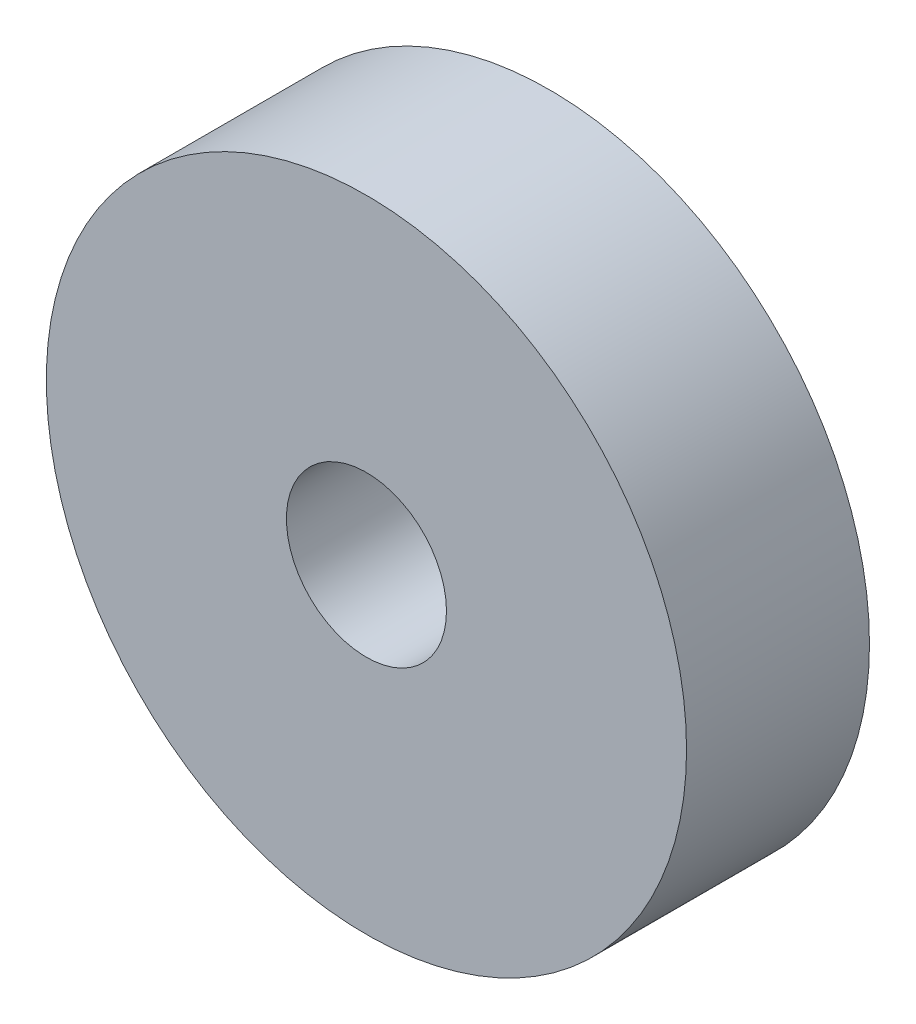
ISO-10303-21;
HEADER;
FILE_DESCRIPTION(('STEP AP214'),'2;1');
FILE_NAME('part.step','',(''),(''),'','','');
FILE_SCHEMA(('AUTOMOTIVE_DESIGN { 1 0 10303 214 1 1 1 1 }'));
ENDSEC;
DATA;
#1=APPLICATION_CONTEXT('core data for automotive mechanical design processes');
#2=APPLICATION_PROTOCOL_DEFINITION('international standard','automotive_design',2000,#1);
#3=PRODUCT_CONTEXT('',#1,'mechanical');
#4=PRODUCT('Part','Part','',(#3));
#5=PRODUCT_RELATED_PRODUCT_CATEGORY('part','',(#4));
#6=PRODUCT_DEFINITION_FORMATION('','',#4);
#7=PRODUCT_DEFINITION_CONTEXT('part definition',#1,'design');
#8=PRODUCT_DEFINITION('design','',#6,#7);
#9=PRODUCT_DEFINITION_SHAPE('','',#8);
#10=(LENGTH_UNIT() NAMED_UNIT(*) SI_UNIT(.MILLI.,.METRE.));
#11=(NAMED_UNIT(*) PLANE_ANGLE_UNIT() SI_UNIT($,.RADIAN.));
#12=(NAMED_UNIT(*) SI_UNIT($,.STERADIAN.) SOLID_ANGLE_UNIT());
#13=UNCERTAINTY_MEASURE_WITH_UNIT(LENGTH_MEASURE(1.E-05),#10,'distance_accuracy_value','');
#14=(GEOMETRIC_REPRESENTATION_CONTEXT(3) GLOBAL_UNCERTAINTY_ASSIGNED_CONTEXT((#13)) GLOBAL_UNIT_ASSIGNED_CONTEXT((#10,
#11,#12)) REPRESENTATION_CONTEXT('',''));
#15=CARTESIAN_POINT('',(0.,0.,0.));
#16=DIRECTION('',(0.,0.,1.));
#17=DIRECTION('',(1.,0.,0.));
#18=AXIS2_PLACEMENT_3D('',#15,#16,#17);
#19=CARTESIAN_POINT('',(0.,0.,4.));
#20=DIRECTION('',(0.,0.,1.));
#21=DIRECTION('',(1.,0.,0.));
#22=AXIS2_PLACEMENT_3D('',#19,#20,#21);
#23=PLANE('',#22);
#24=CARTESIAN_POINT('',(0.,0.,4.));
#25=DIRECTION('',(0.,0.,1.));
#26=DIRECTION('',(1.,0.,0.));
#27=AXIS2_PLACEMENT_3D('',#24,#25,#26);
#28=CIRCLE('',#27,7.);
#29=CARTESIAN_POINT('',(7.,0.,4.));
#30=VERTEX_POINT('',#29);
#31=EDGE_CURVE('E10',#30,#30,#28,.T.);
#32=ORIENTED_EDGE('',*,*,#31,.T.);
#33=EDGE_LOOP('',(#32));
#34=FACE_BOUND('',#33,.T.);
#35=CARTESIAN_POINT('',(0.,0.,4.));
#36=DIRECTION('',(0.,0.,1.));
#37=DIRECTION('',(1.,0.,0.));
#38=AXIS2_PLACEMENT_3D('',#35,#36,#37);
#39=CIRCLE('',#38,1.75);
#40=CARTESIAN_POINT('',(1.75,0.,4.));
#41=VERTEX_POINT('',#40);
#42=EDGE_CURVE('E40',#41,#41,#39,.T.);
#43=ORIENTED_EDGE('',*,*,#42,.F.);
#44=EDGE_LOOP('',(#43));
#45=FACE_BOUND('',#44,.T.);
#46=ADVANCED_FACE('F29',(#34,#45),#23,.T.);
#47=CARTESIAN_POINT('',(0.,0.,0.));
#48=DIRECTION('',(0.,0.,1.));
#49=DIRECTION('',(1.,0.,0.));
#50=AXIS2_PLACEMENT_3D('',#47,#48,#49);
#51=PLANE('',#50);
#52=CARTESIAN_POINT('',(0.,0.,0.));
#53=DIRECTION('',(0.,0.,1.));
#54=DIRECTION('',(1.,0.,0.));
#55=AXIS2_PLACEMENT_3D('',#52,#53,#54);
#56=CIRCLE('',#55,7.);
#57=CARTESIAN_POINT('',(7.,0.,0.));
#58=VERTEX_POINT('',#57);
#59=EDGE_CURVE('E33',#58,#58,#56,.T.);
#60=ORIENTED_EDGE('',*,*,#59,.F.);
#61=EDGE_LOOP('',(#60));
#62=FACE_BOUND('',#61,.T.);
#63=CARTESIAN_POINT('',(0.,0.,0.));
#64=DIRECTION('',(0.,0.,1.));
#65=DIRECTION('',(1.,0.,0.));
#66=AXIS2_PLACEMENT_3D('',#63,#64,#65);
#67=CIRCLE('',#66,1.75);
#68=CARTESIAN_POINT('',(1.75,0.,0.));
#69=VERTEX_POINT('',#68);
#70=EDGE_CURVE('E42',#69,#69,#67,.T.);
#71=ORIENTED_EDGE('',*,*,#70,.T.);
#72=EDGE_LOOP('',(#71));
#73=FACE_BOUND('',#72,.T.);
#74=ADVANCED_FACE('F52',(#62,#73),#51,.F.);
#75=CARTESIAN_POINT('',(0.,0.,4.));
#76=DIRECTION('',(0.,0.,-1.));
#77=DIRECTION('',(-1.,0.,0.));
#78=AXIS2_PLACEMENT_3D('',#75,#76,#77);
#79=CYLINDRICAL_SURFACE('',#78,7.);
#80=ORIENTED_EDGE('',*,*,#31,.F.);
#81=EDGE_LOOP('',(#80));
#82=FACE_BOUND('',#81,.T.);
#83=ORIENTED_EDGE('',*,*,#59,.T.);
#84=EDGE_LOOP('',(#83));
#85=FACE_BOUND('',#84,.T.);
#86=ADVANCED_FACE('F31',(#82,#85),#79,.T.);
#87=CARTESIAN_POINT('',(0.,0.,4.));
#88=DIRECTION('',(0.,0.,-1.));
#89=DIRECTION('',(-1.,0.,0.));
#90=AXIS2_PLACEMENT_3D('',#87,#88,#89);
#91=CYLINDRICAL_SURFACE('',#90,1.75);
#92=ORIENTED_EDGE('',*,*,#42,.T.);
#93=EDGE_LOOP('',(#92));
#94=FACE_BOUND('',#93,.T.);
#95=ORIENTED_EDGE('',*,*,#70,.F.);
#96=EDGE_LOOP('',(#95));
#97=FACE_BOUND('',#96,.T.);
#98=ADVANCED_FACE('F48',(#94,#97),#91,.F.);
#99=CLOSED_SHELL('',(#46,#74,#86,#98));
#100=MANIFOLD_SOLID_BREP('B2',#99);
#101=ADVANCED_BREP_SHAPE_REPRESENTATION('',(#18,#100),#14);
#102=SHAPE_DEFINITION_REPRESENTATION(#9,#101);
ENDSEC;
END-ISO-10303-21;
